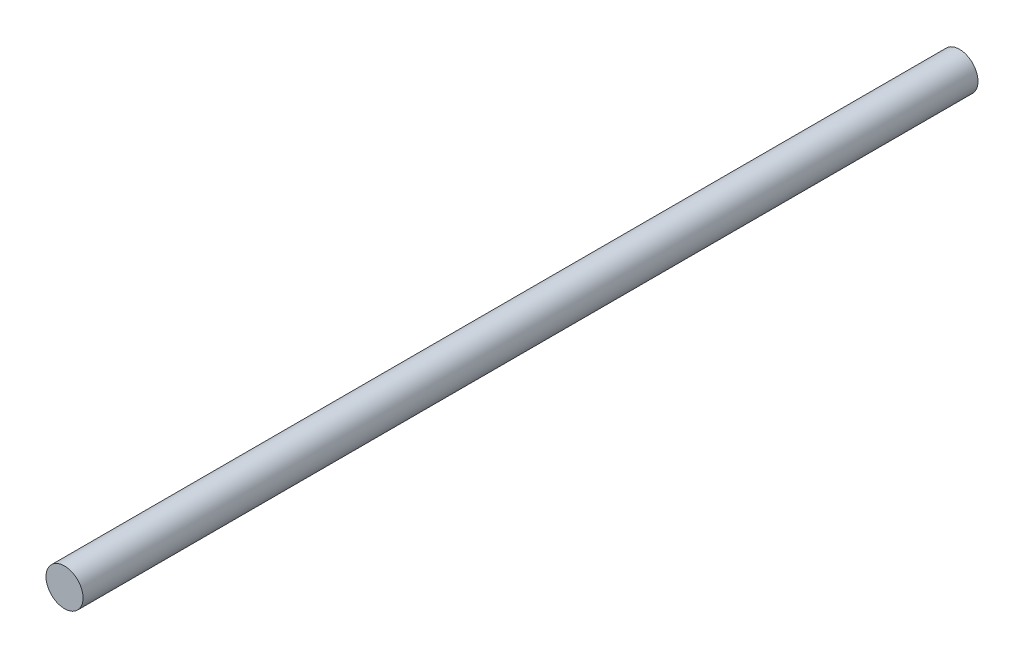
ISO-10303-21;
HEADER;
FILE_DESCRIPTION(('STEP AP214'),'2;1');
FILE_NAME('part.step','',(''),(''),'','','');
FILE_SCHEMA(('AUTOMOTIVE_DESIGN { 1 0 10303 214 1 1 1 1 }'));
ENDSEC;
DATA;
#1=APPLICATION_CONTEXT('core data for automotive mechanical design processes');
#2=APPLICATION_PROTOCOL_DEFINITION('international standard','automotive_design',2000,#1);
#3=PRODUCT_CONTEXT('',#1,'mechanical');
#4=PRODUCT('Part','Part','',(#3));
#5=PRODUCT_RELATED_PRODUCT_CATEGORY('part','',(#4));
#6=PRODUCT_DEFINITION_FORMATION('','',#4);
#7=PRODUCT_DEFINITION_CONTEXT('part definition',#1,'design');
#8=PRODUCT_DEFINITION('design','',#6,#7);
#9=PRODUCT_DEFINITION_SHAPE('','',#8);
#10=(LENGTH_UNIT() NAMED_UNIT(*) SI_UNIT(.MILLI.,.METRE.));
#11=(NAMED_UNIT(*) PLANE_ANGLE_UNIT() SI_UNIT($,.RADIAN.));
#12=(NAMED_UNIT(*) SI_UNIT($,.STERADIAN.) SOLID_ANGLE_UNIT());
#13=UNCERTAINTY_MEASURE_WITH_UNIT(LENGTH_MEASURE(1.E-05),#10,'distance_accuracy_value','');
#14=(GEOMETRIC_REPRESENTATION_CONTEXT(3) GLOBAL_UNCERTAINTY_ASSIGNED_CONTEXT((#13)) GLOBAL_UNIT_ASSIGNED_CONTEXT((#10,
#11,#12)) REPRESENTATION_CONTEXT('',''));
#15=CARTESIAN_POINT('',(0.,0.,0.));
#16=DIRECTION('',(0.,0.,1.));
#17=DIRECTION('',(1.,0.,0.));
#18=AXIS2_PLACEMENT_3D('',#15,#16,#17);
#19=CARTESIAN_POINT('',(0.,0.,724.));
#20=DIRECTION('',(0.,0.,1.));
#21=DIRECTION('',(0.,1.,0.));
#22=AXIS2_PLACEMENT_3D('',#19,#20,#21);
#23=PLANE('',#22);
#24=CARTESIAN_POINT('',(0.,0.,724.));
#25=DIRECTION('',(0.,0.,1.));
#26=DIRECTION('',(0.,1.,0.));
#27=AXIS2_PLACEMENT_3D('',#24,#25,#26);
#28=CIRCLE('',#27,15.);
#29=CARTESIAN_POINT('',(0.,15.,724.));
#30=VERTEX_POINT('',#29);
#31=EDGE_CURVE('E8',#30,#30,#28,.T.);
#32=ORIENTED_EDGE('',*,*,#31,.T.);
#33=EDGE_LOOP('',(#32));
#34=FACE_BOUND('',#33,.T.);
#35=ADVANCED_FACE('F12',(#34),#23,.T.);
#36=CARTESIAN_POINT('',(0.,0.,724.));
#37=DIRECTION('',(0.,0.,-1.));
#38=DIRECTION('',(0.,-1.,0.));
#39=AXIS2_PLACEMENT_3D('',#36,#37,#38);
#40=CYLINDRICAL_SURFACE('',#39,15.);
#41=ORIENTED_EDGE('',*,*,#31,.F.);
#42=EDGE_LOOP('',(#41));
#43=FACE_BOUND('',#42,.T.);
#44=CARTESIAN_POINT('',(0.,0.,0.));
#45=DIRECTION('',(0.,0.,1.));
#46=DIRECTION('',(0.,1.,0.));
#47=AXIS2_PLACEMENT_3D('',#44,#45,#46);
#48=CIRCLE('',#47,15.);
#49=CARTESIAN_POINT('',(0.,15.,0.));
#50=VERTEX_POINT('',#49);
#51=EDGE_CURVE('E16',#50,#50,#48,.T.);
#52=ORIENTED_EDGE('',*,*,#51,.T.);
#53=EDGE_LOOP('',(#52));
#54=FACE_BOUND('',#53,.T.);
#55=ADVANCED_FACE('F14',(#43,#54),#40,.T.);
#56=CARTESIAN_POINT('',(0.,0.,0.));
#57=DIRECTION('',(0.,0.,1.));
#58=DIRECTION('',(0.,1.,0.));
#59=AXIS2_PLACEMENT_3D('',#56,#57,#58);
#60=PLANE('',#59);
#61=ORIENTED_EDGE('',*,*,#51,.F.);
#62=EDGE_LOOP('',(#61));
#63=FACE_BOUND('',#62,.T.);
#64=ADVANCED_FACE('F26',(#63),#60,.F.);
#65=CLOSED_SHELL('',(#35,#55,#64));
#66=MANIFOLD_SOLID_BREP('B1',#65);
#67=ADVANCED_BREP_SHAPE_REPRESENTATION('',(#18,#66),#14);
#68=SHAPE_DEFINITION_REPRESENTATION(#9,#67);
ENDSEC;
END-ISO-10303-21;
